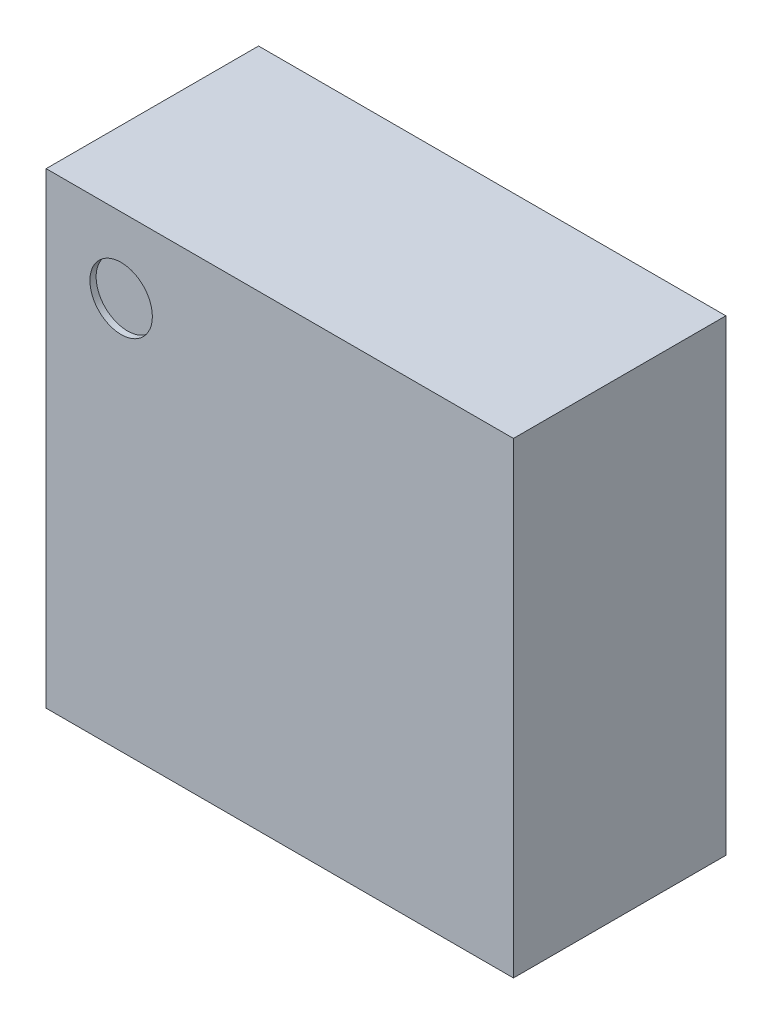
ISO-10303-21;
HEADER;
FILE_DESCRIPTION(('STEP AP214'),'2;1');
FILE_NAME('part.step','',(''),(''),'','','');
FILE_SCHEMA(('AUTOMOTIVE_DESIGN { 1 0 10303 214 1 1 1 1 }'));
ENDSEC;
DATA;
#1=APPLICATION_CONTEXT('core data for automotive mechanical design processes');
#2=APPLICATION_PROTOCOL_DEFINITION('international standard','automotive_design',2000,#1);
#3=PRODUCT_CONTEXT('',#1,'mechanical');
#4=PRODUCT('Part','Part','',(#3));
#5=PRODUCT_RELATED_PRODUCT_CATEGORY('part','',(#4));
#6=PRODUCT_DEFINITION_FORMATION('','',#4);
#7=PRODUCT_DEFINITION_CONTEXT('part definition',#1,'design');
#8=PRODUCT_DEFINITION('design','',#6,#7);
#9=PRODUCT_DEFINITION_SHAPE('','',#8);
#10=(LENGTH_UNIT() NAMED_UNIT(*) SI_UNIT(.MILLI.,.METRE.));
#11=(NAMED_UNIT(*) PLANE_ANGLE_UNIT() SI_UNIT($,.RADIAN.));
#12=(NAMED_UNIT(*) SI_UNIT($,.STERADIAN.) SOLID_ANGLE_UNIT());
#13=UNCERTAINTY_MEASURE_WITH_UNIT(LENGTH_MEASURE(1.E-05),#10,'distance_accuracy_value','');
#14=(GEOMETRIC_REPRESENTATION_CONTEXT(3) GLOBAL_UNCERTAINTY_ASSIGNED_CONTEXT((#13)) GLOBAL_UNIT_ASSIGNED_CONTEXT((#10,
#11,#12)) REPRESENTATION_CONTEXT('',''));
#15=CARTESIAN_POINT('',(0.,0.,0.));
#16=DIRECTION('',(0.,0.,1.));
#17=DIRECTION('',(1.,0.,0.));
#18=AXIS2_PLACEMENT_3D('',#15,#16,#17);
#19=CARTESIAN_POINT('',(0.,0.,0.45000000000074));
#20=DIRECTION('',(0.,0.,1.));
#21=DIRECTION('',(1.,0.,0.));
#22=AXIS2_PLACEMENT_3D('',#19,#20,#21);
#23=PLANE('',#22);
#24=CARTESIAN_POINT('',(-0.254,0.254,0.45000000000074));
#25=DIRECTION('',(0.,0.,1.));
#26=DIRECTION('',(1.,0.,0.));
#27=AXIS2_PLACEMENT_3D('',#24,#25,#26);
#28=CIRCLE('',#27,0.0500000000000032);
#29=CARTESIAN_POINT('',(-0.203999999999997,0.254,0.45000000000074));
#30=VERTEX_POINT('',#29);
#31=EDGE_CURVE('E19',#30,#30,#28,.T.);
#32=ORIENTED_EDGE('',*,*,#31,.T.);
#33=EDGE_LOOP('',(#32));
#34=FACE_BOUND('',#33,.T.);
#35=ADVANCED_FACE('F16',(#34),#23,.T.);
#36=CARTESIAN_POINT('',(-0.254,0.254,0.4600000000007));
#37=DIRECTION('',(0.,0.,1.));
#38=DIRECTION('',(1.,0.,0.));
#39=AXIS2_PLACEMENT_3D('',#36,#37,#38);
#40=CYLINDRICAL_SURFACE('',#39,0.0500000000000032);
#41=ORIENTED_EDGE('',*,*,#31,.F.);
#42=EDGE_LOOP('',(#41));
#43=FACE_BOUND('',#42,.T.);
#44=CARTESIAN_POINT('',(-0.254,0.254,0.4600000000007));
#45=DIRECTION('',(0.,0.,1.));
#46=DIRECTION('',(1.,0.,0.));
#47=AXIS2_PLACEMENT_3D('',#44,#45,#46);
#48=CIRCLE('',#47,0.0500000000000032);
#49=CARTESIAN_POINT('',(-0.203999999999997,0.254,0.4600000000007));
#50=VERTEX_POINT('',#49);
#51=EDGE_CURVE('E74',#50,#50,#48,.F.);
#52=ORIENTED_EDGE('',*,*,#51,.F.);
#53=EDGE_LOOP('',(#52));
#54=FACE_BOUND('',#53,.T.);
#55=ADVANCED_FACE('F89',(#43,#54),#40,.F.);
#56=CARTESIAN_POINT('',(0.,0.,0.4600000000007));
#57=DIRECTION('',(0.,0.,1.));
#58=DIRECTION('',(1.,0.,0.));
#59=AXIS2_PLACEMENT_3D('',#56,#57,#58);
#60=PLANE('',#59);
#61=ORIENTED_EDGE('',*,*,#51,.T.);
#62=EDGE_LOOP('',(#61));
#63=FACE_BOUND('',#62,.T.);
#64=DIRECTION('',(1.,0.,0.));
#65=VECTOR('',#64,1.);
#66=CARTESIAN_POINT('',(0.374000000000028,0.374000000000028,0.4600000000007));
#67=LINE('',#66,#65);
#68=CARTESIAN_POINT('',(-0.374000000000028,0.374000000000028,0.4600000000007));
#69=VERTEX_POINT('',#68);
#70=CARTESIAN_POINT('',(0.374000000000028,0.374000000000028,0.4600000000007));
#71=VERTEX_POINT('',#70);
#72=EDGE_CURVE('E70',#69,#71,#67,.T.);
#73=ORIENTED_EDGE('',*,*,#72,.F.);
#74=DIRECTION('',(0.,1.,0.));
#75=VECTOR('',#74,1.);
#76=CARTESIAN_POINT('',(-0.374000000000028,0.374000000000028,0.4600000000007));
#77=LINE('',#76,#75);
#78=CARTESIAN_POINT('',(-0.374000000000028,-0.374000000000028,0.4600000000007));
#79=VERTEX_POINT('',#78);
#80=EDGE_CURVE('E66',#79,#69,#77,.T.);
#81=ORIENTED_EDGE('',*,*,#80,.F.);
#82=DIRECTION('',(1.,0.,0.));
#83=VECTOR('',#82,1.);
#84=CARTESIAN_POINT('',(-0.374000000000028,-0.374000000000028,0.4600000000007));
#85=LINE('',#84,#83);
#86=CARTESIAN_POINT('',(0.374000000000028,-0.374000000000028,0.4600000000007));
#87=VERTEX_POINT('',#86);
#88=EDGE_CURVE('E57',#87,#79,#85,.F.);
#89=ORIENTED_EDGE('',*,*,#88,.F.);
#90=DIRECTION('',(0.,1.,0.));
#91=VECTOR('',#90,1.);
#92=CARTESIAN_POINT('',(0.374000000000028,-0.374000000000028,0.4600000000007));
#93=LINE('',#92,#91);
#94=EDGE_CURVE('E52',#71,#87,#93,.F.);
#95=ORIENTED_EDGE('',*,*,#94,.F.);
#96=EDGE_LOOP('',(#73,#81,#89,#95));
#97=FACE_BOUND('',#96,.T.);
#98=ADVANCED_FACE('F69',(#63,#97),#60,.T.);
#99=CARTESIAN_POINT('',(-0.374000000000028,0.374000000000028,0.));
#100=DIRECTION('',(-1.,0.,0.));
#101=DIRECTION('',(0.,0.,1.));
#102=AXIS2_PLACEMENT_3D('',#99,#100,#101);
#103=PLANE('',#102);
#104=DIRECTION('',(0.,0.,1.));
#105=VECTOR('',#104,1.);
#106=CARTESIAN_POINT('',(-0.374000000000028,0.374000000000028,0.));
#107=LINE('',#106,#105);
#108=CARTESIAN_POINT('',(-0.374000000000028,0.374000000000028,0.11999999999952));
#109=VERTEX_POINT('',#108);
#110=EDGE_CURVE('E197',#109,#69,#107,.T.);
#111=ORIENTED_EDGE('',*,*,#110,.F.);
#112=DIRECTION('',(0.,1.,0.));
#113=VECTOR('',#112,1.);
#114=CARTESIAN_POINT('',(-0.374000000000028,0.,0.11999999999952));
#115=LINE('',#114,#113);
#116=CARTESIAN_POINT('',(-0.374000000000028,-0.374000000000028,0.11999999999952));
#117=VERTEX_POINT('',#116);
#118=EDGE_CURVE('E78',#109,#117,#115,.F.);
#119=ORIENTED_EDGE('',*,*,#118,.T.);
#120=DIRECTION('',(0.,0.,-1.));
#121=VECTOR('',#120,1.);
#122=CARTESIAN_POINT('',(-0.374000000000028,-0.374000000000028,0.));
#123=LINE('',#122,#121);
#124=EDGE_CURVE('E62',#79,#117,#123,.T.);
#125=ORIENTED_EDGE('',*,*,#124,.F.);
#126=ORIENTED_EDGE('',*,*,#80,.T.);
#127=EDGE_LOOP('',(#111,#119,#125,#126));
#128=FACE_BOUND('',#127,.T.);
#129=ADVANCED_FACE('F77',(#128),#103,.T.);
#130=CARTESIAN_POINT('',(-0.374000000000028,-0.374000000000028,0.));
#131=DIRECTION('',(0.,-1.,0.));
#132=DIRECTION('',(0.,0.,-1.));
#133=AXIS2_PLACEMENT_3D('',#130,#131,#132);
#134=PLANE('',#133);
#135=ORIENTED_EDGE('',*,*,#124,.T.);
#136=DIRECTION('',(1.,0.,0.));
#137=VECTOR('',#136,1.);
#138=CARTESIAN_POINT('',(0.,-0.374000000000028,0.11999999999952));
#139=LINE('',#138,#137);
#140=CARTESIAN_POINT('',(0.374000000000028,-0.374000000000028,0.11999999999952));
#141=VERTEX_POINT('',#140);
#142=EDGE_CURVE('E198',#117,#141,#139,.T.);
#143=ORIENTED_EDGE('',*,*,#142,.T.);
#144=DIRECTION('',(0.,0.,-1.));
#145=VECTOR('',#144,1.);
#146=CARTESIAN_POINT('',(0.374000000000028,-0.374000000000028,0.));
#147=LINE('',#146,#145);
#148=EDGE_CURVE('E64',#87,#141,#147,.T.);
#149=ORIENTED_EDGE('',*,*,#148,.F.);
#150=ORIENTED_EDGE('',*,*,#88,.T.);
#151=EDGE_LOOP('',(#135,#143,#149,#150));
#152=FACE_BOUND('',#151,.T.);
#153=ADVANCED_FACE('F59',(#152),#134,.T.);
#154=CARTESIAN_POINT('',(0.374000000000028,-0.374000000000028,0.));
#155=DIRECTION('',(1.,0.,0.));
#156=DIRECTION('',(0.,0.,-1.));
#157=AXIS2_PLACEMENT_3D('',#154,#155,#156);
#158=PLANE('',#157);
#159=ORIENTED_EDGE('',*,*,#148,.T.);
#160=DIRECTION('',(0.,1.,0.));
#161=VECTOR('',#160,1.);
#162=CARTESIAN_POINT('',(0.374000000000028,0.,0.11999999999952));
#163=LINE('',#162,#161);
#164=CARTESIAN_POINT('',(0.374000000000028,0.374000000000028,0.11999999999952));
#165=VERTEX_POINT('',#164);
#166=EDGE_CURVE('E25',#141,#165,#163,.T.);
#167=ORIENTED_EDGE('',*,*,#166,.T.);
#168=DIRECTION('',(0.,0.,1.));
#169=VECTOR('',#168,1.);
#170=CARTESIAN_POINT('',(0.374000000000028,0.374000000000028,0.));
#171=LINE('',#170,#169);
#172=EDGE_CURVE('E33',#71,#165,#171,.F.);
#173=ORIENTED_EDGE('',*,*,#172,.F.);
#174=ORIENTED_EDGE('',*,*,#94,.T.);
#175=EDGE_LOOP('',(#159,#167,#173,#174));
#176=FACE_BOUND('',#175,.T.);
#177=ADVANCED_FACE('F106',(#176),#158,.T.);
#178=CARTESIAN_POINT('',(0.374000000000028,0.374000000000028,0.));
#179=DIRECTION('',(0.,1.,0.));
#180=DIRECTION('',(0.,0.,1.));
#181=AXIS2_PLACEMENT_3D('',#178,#179,#180);
#182=PLANE('',#181);
#183=ORIENTED_EDGE('',*,*,#172,.T.);
#184=DIRECTION('',(1.,0.,0.));
#185=VECTOR('',#184,1.);
#186=CARTESIAN_POINT('',(0.,0.374000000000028,0.11999999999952));
#187=LINE('',#186,#185);
#188=EDGE_CURVE('E11',#165,#109,#187,.F.);
#189=ORIENTED_EDGE('',*,*,#188,.T.);
#190=ORIENTED_EDGE('',*,*,#110,.T.);
#191=ORIENTED_EDGE('',*,*,#72,.T.);
#192=EDGE_LOOP('',(#183,#189,#190,#191));
#193=FACE_BOUND('',#192,.T.);
#194=ADVANCED_FACE('F100',(#193),#182,.T.);
#195=CARTESIAN_POINT('',(0.,0.,0.11999999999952));
#196=DIRECTION('',(0.,0.,1.));
#197=DIRECTION('',(1.,0.,0.));
#198=AXIS2_PLACEMENT_3D('',#195,#196,#197);
#199=PLANE('',#198);
#200=ORIENTED_EDGE('',*,*,#166,.F.);
#201=ORIENTED_EDGE('',*,*,#142,.F.);
#202=ORIENTED_EDGE('',*,*,#118,.F.);
#203=ORIENTED_EDGE('',*,*,#188,.F.);
#204=EDGE_LOOP('',(#200,#201,#202,#203));
#205=FACE_BOUND('',#204,.T.);
#206=ADVANCED_FACE('F98',(#205),#199,.F.);
#207=CLOSED_SHELL('',(#35,#55,#98,#129,#153,#177,#194,#206));
#208=MANIFOLD_SOLID_BREP('B1',#207);
#209=ADVANCED_BREP_SHAPE_REPRESENTATION('',(#18,#208),#14);
#210=SHAPE_DEFINITION_REPRESENTATION(#9,#209);
ENDSEC;
END-ISO-10303-21;
